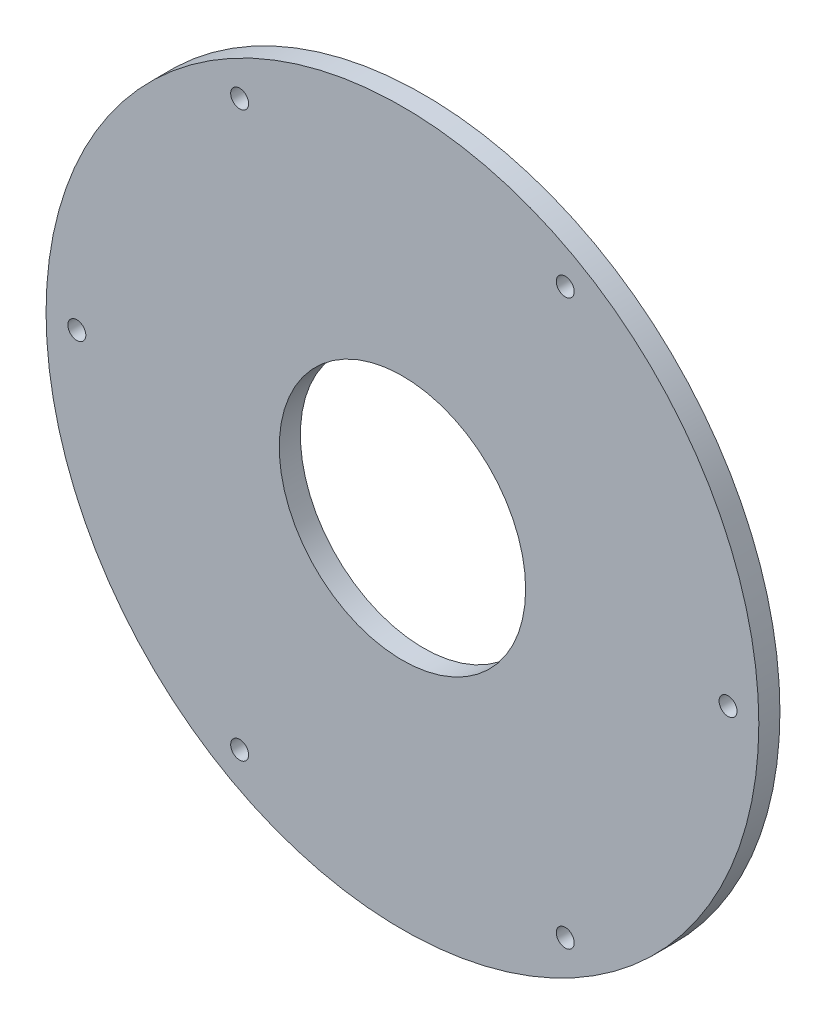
ISO-10303-21;
HEADER;
FILE_DESCRIPTION(('STEP AP214'),'2;1');
FILE_NAME('part.step','',(''),(''),'','','');
FILE_SCHEMA(('AUTOMOTIVE_DESIGN { 1 0 10303 214 1 1 1 1 }'));
ENDSEC;
DATA;
#1=APPLICATION_CONTEXT('core data for automotive mechanical design processes');
#2=APPLICATION_PROTOCOL_DEFINITION('international standard','automotive_design',2000,#1);
#3=PRODUCT_CONTEXT('',#1,'mechanical');
#4=PRODUCT('Part','Part','',(#3));
#5=PRODUCT_RELATED_PRODUCT_CATEGORY('part','',(#4));
#6=PRODUCT_DEFINITION_FORMATION('','',#4);
#7=PRODUCT_DEFINITION_CONTEXT('part definition',#1,'design');
#8=PRODUCT_DEFINITION('design','',#6,#7);
#9=PRODUCT_DEFINITION_SHAPE('','',#8);
#10=(LENGTH_UNIT() NAMED_UNIT(*) SI_UNIT(.MILLI.,.METRE.));
#11=(NAMED_UNIT(*) PLANE_ANGLE_UNIT() SI_UNIT($,.RADIAN.));
#12=(NAMED_UNIT(*) SI_UNIT($,.STERADIAN.) SOLID_ANGLE_UNIT());
#13=UNCERTAINTY_MEASURE_WITH_UNIT(LENGTH_MEASURE(1.E-05),#10,'distance_accuracy_value','');
#14=(GEOMETRIC_REPRESENTATION_CONTEXT(3) GLOBAL_UNCERTAINTY_ASSIGNED_CONTEXT((#13)) GLOBAL_UNIT_ASSIGNED_CONTEXT((#10,
#11,#12)) REPRESENTATION_CONTEXT('',''));
#15=CARTESIAN_POINT('',(0.,0.,0.));
#16=DIRECTION('',(0.,0.,1.));
#17=DIRECTION('',(1.,0.,0.));
#18=AXIS2_PLACEMENT_3D('',#15,#16,#17);
#19=CARTESIAN_POINT('',(0.,0.,12.));
#20=DIRECTION('',(0.,0.,1.));
#21=DIRECTION('',(1.,0.,0.));
#22=AXIS2_PLACEMENT_3D('',#19,#20,#21);
#23=PLANE('',#22);
#24=CARTESIAN_POINT('',(-92.5000000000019,-160.21469970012,12.));
#25=DIRECTION('',(0.,0.,1.));
#26=DIRECTION('',(1.,0.,0.));
#27=AXIS2_PLACEMENT_3D('',#24,#25,#26);
#28=CIRCLE('',#27,5.09999999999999);
#29=CARTESIAN_POINT('',(-87.4000000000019,-160.21469970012,12.));
#30=VERTEX_POINT('',#29);
#31=EDGE_CURVE('E83',#30,#30,#28,.T.);
#32=ORIENTED_EDGE('',*,*,#31,.F.);
#33=EDGE_LOOP('',(#32));
#34=FACE_BOUND('',#33,.T.);
#35=CARTESIAN_POINT('',(92.4999999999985,-160.214699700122,12.));
#36=DIRECTION('',(0.,0.,1.));
#37=DIRECTION('',(1.,0.,0.));
#38=AXIS2_PLACEMENT_3D('',#35,#36,#37);
#39=CIRCLE('',#38,5.09999999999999);
#40=CARTESIAN_POINT('',(97.5999999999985,-160.214699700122,12.));
#41=VERTEX_POINT('',#40);
#42=EDGE_CURVE('E77',#41,#41,#39,.T.);
#43=ORIENTED_EDGE('',*,*,#42,.F.);
#44=EDGE_LOOP('',(#43));
#45=FACE_BOUND('',#44,.T.);
#46=CARTESIAN_POINT('',(185.,0.,12.));
#47=DIRECTION('',(0.,0.,1.));
#48=DIRECTION('',(1.,0.,0.));
#49=AXIS2_PLACEMENT_3D('',#46,#47,#48);
#50=CIRCLE('',#49,5.09999999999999);
#51=CARTESIAN_POINT('',(190.1,0.,12.));
#52=VERTEX_POINT('',#51);
#53=EDGE_CURVE('E71',#52,#52,#50,.T.);
#54=ORIENTED_EDGE('',*,*,#53,.F.);
#55=EDGE_LOOP('',(#54));
#56=FACE_BOUND('',#55,.T.);
#57=CARTESIAN_POINT('',(92.5000000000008,160.214699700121,12.));
#58=DIRECTION('',(0.,0.,1.));
#59=DIRECTION('',(1.,0.,0.));
#60=AXIS2_PLACEMENT_3D('',#57,#58,#59);
#61=CIRCLE('',#60,5.09999999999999);
#62=CARTESIAN_POINT('',(97.6000000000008,160.214699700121,12.));
#63=VERTEX_POINT('',#62);
#64=EDGE_CURVE('E65',#63,#63,#61,.T.);
#65=ORIENTED_EDGE('',*,*,#64,.F.);
#66=EDGE_LOOP('',(#65));
#67=FACE_BOUND('',#66,.T.);
#68=CARTESIAN_POINT('',(-92.4999999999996,160.214699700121,12.));
#69=DIRECTION('',(0.,0.,1.));
#70=DIRECTION('',(1.,0.,0.));
#71=AXIS2_PLACEMENT_3D('',#68,#69,#70);
#72=CIRCLE('',#71,5.09999999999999);
#73=CARTESIAN_POINT('',(-87.3999999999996,160.214699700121,12.));
#74=VERTEX_POINT('',#73);
#75=EDGE_CURVE('E59',#74,#74,#72,.T.);
#76=ORIENTED_EDGE('',*,*,#75,.F.);
#77=EDGE_LOOP('',(#76));
#78=FACE_BOUND('',#77,.T.);
#79=CARTESIAN_POINT('',(-185.,0.,12.));
#80=DIRECTION('',(0.,0.,1.));
#81=DIRECTION('',(1.,0.,0.));
#82=AXIS2_PLACEMENT_3D('',#79,#80,#81);
#83=CIRCLE('',#82,5.09999999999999);
#84=CARTESIAN_POINT('',(-179.9,0.,12.));
#85=VERTEX_POINT('',#84);
#86=EDGE_CURVE('E53',#85,#85,#83,.T.);
#87=ORIENTED_EDGE('',*,*,#86,.F.);
#88=EDGE_LOOP('',(#87));
#89=FACE_BOUND('',#88,.T.);
#90=CARTESIAN_POINT('',(0.,0.,12.));
#91=DIRECTION('',(0.,0.,1.));
#92=DIRECTION('',(1.,0.,0.));
#93=AXIS2_PLACEMENT_3D('',#90,#91,#92);
#94=CIRCLE('',#93,202.5);
#95=CARTESIAN_POINT('',(202.5,0.,12.));
#96=VERTEX_POINT('',#95);
#97=EDGE_CURVE('E10',#96,#96,#94,.T.);
#98=ORIENTED_EDGE('',*,*,#97,.T.);
#99=EDGE_LOOP('',(#98));
#100=FACE_BOUND('',#99,.T.);
#101=CARTESIAN_POINT('',(0.,0.,12.));
#102=DIRECTION('',(0.,0.,1.));
#103=DIRECTION('',(1.,0.,0.));
#104=AXIS2_PLACEMENT_3D('',#101,#102,#103);
#105=CIRCLE('',#104,70.);
#106=CARTESIAN_POINT('',(70.,0.,12.));
#107=VERTEX_POINT('',#106);
#108=EDGE_CURVE('E43',#107,#107,#105,.T.);
#109=ORIENTED_EDGE('',*,*,#108,.F.);
#110=EDGE_LOOP('',(#109));
#111=FACE_BOUND('',#110,.T.);
#112=ADVANCED_FACE('F32',(#34,#45,#56,#67,#78,#89,#100,#111),#23,.T.);
#113=CARTESIAN_POINT('',(0.,0.,0.));
#114=DIRECTION('',(0.,0.,1.));
#115=DIRECTION('',(1.,0.,0.));
#116=AXIS2_PLACEMENT_3D('',#113,#114,#115);
#117=PLANE('',#116);
#118=CARTESIAN_POINT('',(-92.5000000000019,-160.21469970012,0.));
#119=DIRECTION('',(0.,0.,1.));
#120=DIRECTION('',(1.,0.,0.));
#121=AXIS2_PLACEMENT_3D('',#118,#119,#120);
#122=CIRCLE('',#121,5.09999999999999);
#123=CARTESIAN_POINT('',(-87.4000000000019,-160.21469970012,0.));
#124=VERTEX_POINT('',#123);
#125=EDGE_CURVE('E80',#124,#124,#122,.T.);
#126=ORIENTED_EDGE('',*,*,#125,.T.);
#127=EDGE_LOOP('',(#126));
#128=FACE_BOUND('',#127,.T.);
#129=CARTESIAN_POINT('',(92.4999999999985,-160.214699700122,0.));
#130=DIRECTION('',(0.,0.,1.));
#131=DIRECTION('',(1.,0.,0.));
#132=AXIS2_PLACEMENT_3D('',#129,#130,#131);
#133=CIRCLE('',#132,5.09999999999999);
#134=CARTESIAN_POINT('',(97.5999999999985,-160.214699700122,0.));
#135=VERTEX_POINT('',#134);
#136=EDGE_CURVE('E74',#135,#135,#133,.T.);
#137=ORIENTED_EDGE('',*,*,#136,.T.);
#138=EDGE_LOOP('',(#137));
#139=FACE_BOUND('',#138,.T.);
#140=CARTESIAN_POINT('',(185.,0.,0.));
#141=DIRECTION('',(0.,0.,1.));
#142=DIRECTION('',(1.,0.,0.));
#143=AXIS2_PLACEMENT_3D('',#140,#141,#142);
#144=CIRCLE('',#143,5.09999999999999);
#145=CARTESIAN_POINT('',(190.1,0.,0.));
#146=VERTEX_POINT('',#145);
#147=EDGE_CURVE('E68',#146,#146,#144,.T.);
#148=ORIENTED_EDGE('',*,*,#147,.T.);
#149=EDGE_LOOP('',(#148));
#150=FACE_BOUND('',#149,.T.);
#151=CARTESIAN_POINT('',(92.5000000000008,160.214699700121,0.));
#152=DIRECTION('',(0.,0.,1.));
#153=DIRECTION('',(1.,0.,0.));
#154=AXIS2_PLACEMENT_3D('',#151,#152,#153);
#155=CIRCLE('',#154,5.09999999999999);
#156=CARTESIAN_POINT('',(97.6000000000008,160.214699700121,0.));
#157=VERTEX_POINT('',#156);
#158=EDGE_CURVE('E62',#157,#157,#155,.T.);
#159=ORIENTED_EDGE('',*,*,#158,.T.);
#160=EDGE_LOOP('',(#159));
#161=FACE_BOUND('',#160,.T.);
#162=CARTESIAN_POINT('',(-92.4999999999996,160.214699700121,0.));
#163=DIRECTION('',(0.,0.,1.));
#164=DIRECTION('',(1.,0.,0.));
#165=AXIS2_PLACEMENT_3D('',#162,#163,#164);
#166=CIRCLE('',#165,5.09999999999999);
#167=CARTESIAN_POINT('',(-87.3999999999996,160.214699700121,0.));
#168=VERTEX_POINT('',#167);
#169=EDGE_CURVE('E56',#168,#168,#166,.T.);
#170=ORIENTED_EDGE('',*,*,#169,.T.);
#171=EDGE_LOOP('',(#170));
#172=FACE_BOUND('',#171,.T.);
#173=CARTESIAN_POINT('',(-185.,0.,0.));
#174=DIRECTION('',(0.,0.,1.));
#175=DIRECTION('',(1.,0.,0.));
#176=AXIS2_PLACEMENT_3D('',#173,#174,#175);
#177=CIRCLE('',#176,5.09999999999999);
#178=CARTESIAN_POINT('',(-179.9,0.,0.));
#179=VERTEX_POINT('',#178);
#180=EDGE_CURVE('E48',#179,#179,#177,.T.);
#181=ORIENTED_EDGE('',*,*,#180,.T.);
#182=EDGE_LOOP('',(#181));
#183=FACE_BOUND('',#182,.T.);
#184=CARTESIAN_POINT('',(0.,0.,0.));
#185=DIRECTION('',(0.,0.,1.));
#186=DIRECTION('',(1.,0.,0.));
#187=AXIS2_PLACEMENT_3D('',#184,#185,#186);
#188=CIRCLE('',#187,202.5);
#189=CARTESIAN_POINT('',(202.5,0.,0.));
#190=VERTEX_POINT('',#189);
#191=EDGE_CURVE('E36',#190,#190,#188,.T.);
#192=ORIENTED_EDGE('',*,*,#191,.F.);
#193=EDGE_LOOP('',(#192));
#194=FACE_BOUND('',#193,.T.);
#195=CARTESIAN_POINT('',(0.,0.,0.));
#196=DIRECTION('',(0.,0.,1.));
#197=DIRECTION('',(1.,0.,0.));
#198=AXIS2_PLACEMENT_3D('',#195,#196,#197);
#199=CIRCLE('',#198,70.);
#200=CARTESIAN_POINT('',(70.,0.,0.));
#201=VERTEX_POINT('',#200);
#202=EDGE_CURVE('E45',#201,#201,#199,.T.);
#203=ORIENTED_EDGE('',*,*,#202,.T.);
#204=EDGE_LOOP('',(#203));
#205=FACE_BOUND('',#204,.T.);
#206=ADVANCED_FACE('F91',(#128,#139,#150,#161,#172,#183,#194,#205),#117,.F.);
#207=CARTESIAN_POINT('',(0.,0.,12.));
#208=DIRECTION('',(0.,0.,-1.));
#209=DIRECTION('',(-1.,0.,0.));
#210=AXIS2_PLACEMENT_3D('',#207,#208,#209);
#211=CYLINDRICAL_SURFACE('',#210,202.5);
#212=ORIENTED_EDGE('',*,*,#97,.F.);
#213=EDGE_LOOP('',(#212));
#214=FACE_BOUND('',#213,.T.);
#215=ORIENTED_EDGE('',*,*,#191,.T.);
#216=EDGE_LOOP('',(#215));
#217=FACE_BOUND('',#216,.T.);
#218=ADVANCED_FACE('F34',(#214,#217),#211,.T.);
#219=CARTESIAN_POINT('',(0.,0.,12.));
#220=DIRECTION('',(0.,0.,-1.));
#221=DIRECTION('',(-1.,0.,0.));
#222=AXIS2_PLACEMENT_3D('',#219,#220,#221);
#223=CYLINDRICAL_SURFACE('',#222,70.);
#224=ORIENTED_EDGE('',*,*,#108,.T.);
#225=EDGE_LOOP('',(#224));
#226=FACE_BOUND('',#225,.T.);
#227=ORIENTED_EDGE('',*,*,#202,.F.);
#228=EDGE_LOOP('',(#227));
#229=FACE_BOUND('',#228,.T.);
#230=ADVANCED_FACE('F105',(#226,#229),#223,.F.);
#231=CARTESIAN_POINT('',(-185.,0.,12.));
#232=DIRECTION('',(0.,0.,1.));
#233=DIRECTION('',(1.,0.,0.));
#234=AXIS2_PLACEMENT_3D('',#231,#232,#233);
#235=CYLINDRICAL_SURFACE('',#234,5.09999999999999);
#236=ORIENTED_EDGE('',*,*,#180,.F.);
#237=EDGE_LOOP('',(#236));
#238=FACE_BOUND('',#237,.T.);
#239=ORIENTED_EDGE('',*,*,#86,.T.);
#240=EDGE_LOOP('',(#239));
#241=FACE_BOUND('',#240,.T.);
#242=ADVANCED_FACE('F108',(#238,#241),#235,.F.);
#243=CARTESIAN_POINT('',(-92.4999999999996,160.214699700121,12.));
#244=DIRECTION('',(0.,0.,1.));
#245=DIRECTION('',(1.,0.,0.));
#246=AXIS2_PLACEMENT_3D('',#243,#244,#245);
#247=CYLINDRICAL_SURFACE('',#246,5.09999999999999);
#248=ORIENTED_EDGE('',*,*,#169,.F.);
#249=EDGE_LOOP('',(#248));
#250=FACE_BOUND('',#249,.T.);
#251=ORIENTED_EDGE('',*,*,#75,.T.);
#252=EDGE_LOOP('',(#251));
#253=FACE_BOUND('',#252,.T.);
#254=ADVANCED_FACE('F122',(#250,#253),#247,.F.);
#255=CARTESIAN_POINT('',(92.5000000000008,160.214699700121,12.));
#256=DIRECTION('',(0.,0.,1.));
#257=DIRECTION('',(1.,0.,0.));
#258=AXIS2_PLACEMENT_3D('',#255,#256,#257);
#259=CYLINDRICAL_SURFACE('',#258,5.09999999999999);
#260=ORIENTED_EDGE('',*,*,#158,.F.);
#261=EDGE_LOOP('',(#260));
#262=FACE_BOUND('',#261,.T.);
#263=ORIENTED_EDGE('',*,*,#64,.T.);
#264=EDGE_LOOP('',(#263));
#265=FACE_BOUND('',#264,.T.);
#266=ADVANCED_FACE('F126',(#262,#265),#259,.F.);
#267=CARTESIAN_POINT('',(185.,0.,12.));
#268=DIRECTION('',(0.,0.,1.));
#269=DIRECTION('',(1.,0.,0.));
#270=AXIS2_PLACEMENT_3D('',#267,#268,#269);
#271=CYLINDRICAL_SURFACE('',#270,5.09999999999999);
#272=ORIENTED_EDGE('',*,*,#147,.F.);
#273=EDGE_LOOP('',(#272));
#274=FACE_BOUND('',#273,.T.);
#275=ORIENTED_EDGE('',*,*,#53,.T.);
#276=EDGE_LOOP('',(#275));
#277=FACE_BOUND('',#276,.T.);
#278=ADVANCED_FACE('F130',(#274,#277),#271,.F.);
#279=CARTESIAN_POINT('',(92.4999999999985,-160.214699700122,12.));
#280=DIRECTION('',(0.,0.,1.));
#281=DIRECTION('',(1.,0.,0.));
#282=AXIS2_PLACEMENT_3D('',#279,#280,#281);
#283=CYLINDRICAL_SURFACE('',#282,5.09999999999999);
#284=ORIENTED_EDGE('',*,*,#136,.F.);
#285=EDGE_LOOP('',(#284));
#286=FACE_BOUND('',#285,.T.);
#287=ORIENTED_EDGE('',*,*,#42,.T.);
#288=EDGE_LOOP('',(#287));
#289=FACE_BOUND('',#288,.T.);
#290=ADVANCED_FACE('F134',(#286,#289),#283,.F.);
#291=CARTESIAN_POINT('',(-92.5000000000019,-160.21469970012,12.));
#292=DIRECTION('',(0.,0.,1.));
#293=DIRECTION('',(1.,0.,0.));
#294=AXIS2_PLACEMENT_3D('',#291,#292,#293);
#295=CYLINDRICAL_SURFACE('',#294,5.09999999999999);
#296=ORIENTED_EDGE('',*,*,#125,.F.);
#297=EDGE_LOOP('',(#296));
#298=FACE_BOUND('',#297,.T.);
#299=ORIENTED_EDGE('',*,*,#31,.T.);
#300=EDGE_LOOP('',(#299));
#301=FACE_BOUND('',#300,.T.);
#302=ADVANCED_FACE('F87',(#298,#301),#295,.F.);
#303=CLOSED_SHELL('',(#112,#206,#218,#230,#242,#254,#266,#278,#290,#302));
#304=MANIFOLD_SOLID_BREP('B2',#303);
#305=ADVANCED_BREP_SHAPE_REPRESENTATION('',(#18,#304),#14);
#306=SHAPE_DEFINITION_REPRESENTATION(#9,#305);
ENDSEC;
END-ISO-10303-21;
